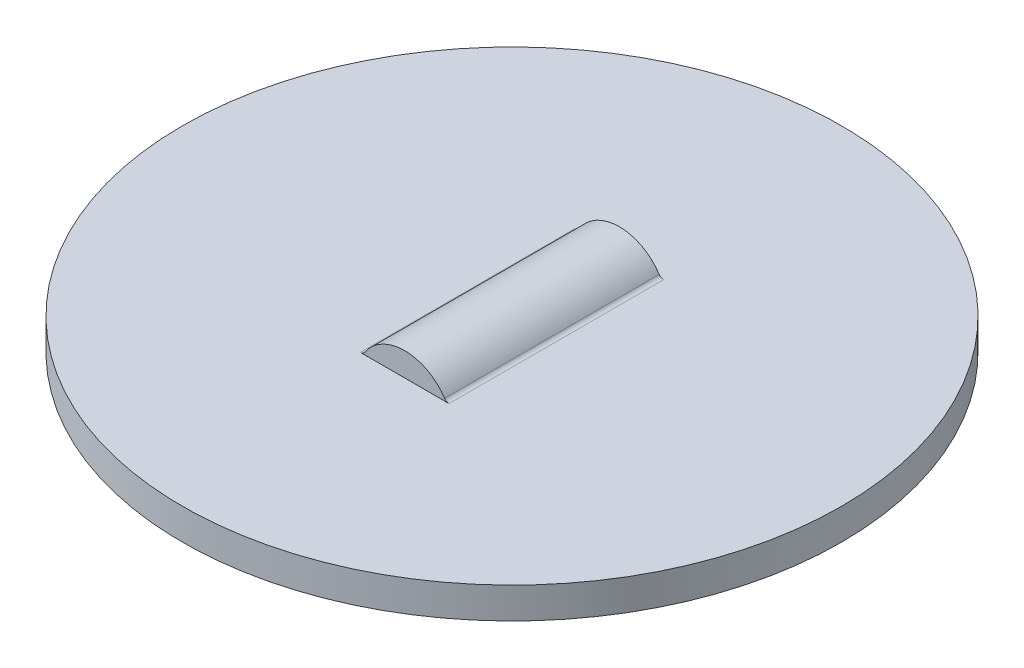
ISO-10303-21;
HEADER;
FILE_DESCRIPTION(('STEP AP214'),'2;1');
FILE_NAME('part.step','',(''),(''),'','','');
FILE_SCHEMA(('AUTOMOTIVE_DESIGN { 1 0 10303 214 1 1 1 1 }'));
ENDSEC;
DATA;
#1=APPLICATION_CONTEXT('core data for automotive mechanical design processes');
#2=APPLICATION_PROTOCOL_DEFINITION('international standard','automotive_design',2000,#1);
#3=PRODUCT_CONTEXT('',#1,'mechanical');
#4=PRODUCT('Part','Part','',(#3));
#5=PRODUCT_RELATED_PRODUCT_CATEGORY('part','',(#4));
#6=PRODUCT_DEFINITION_FORMATION('','',#4);
#7=PRODUCT_DEFINITION_CONTEXT('part definition',#1,'design');
#8=PRODUCT_DEFINITION('design','',#6,#7);
#9=PRODUCT_DEFINITION_SHAPE('','',#8);
#10=(LENGTH_UNIT() NAMED_UNIT(*) SI_UNIT(.MILLI.,.METRE.));
#11=(NAMED_UNIT(*) PLANE_ANGLE_UNIT() SI_UNIT($,.RADIAN.));
#12=(NAMED_UNIT(*) SI_UNIT($,.STERADIAN.) SOLID_ANGLE_UNIT());
#13=UNCERTAINTY_MEASURE_WITH_UNIT(LENGTH_MEASURE(1.E-05),#10,'distance_accuracy_value','');
#14=(GEOMETRIC_REPRESENTATION_CONTEXT(3) GLOBAL_UNCERTAINTY_ASSIGNED_CONTEXT((#13)) GLOBAL_UNIT_ASSIGNED_CONTEXT((#10,
#11,#12)) REPRESENTATION_CONTEXT('',''));
#15=CARTESIAN_POINT('',(0.,0.,0.));
#16=DIRECTION('',(0.,0.,1.));
#17=DIRECTION('',(1.,0.,0.));
#18=AXIS2_PLACEMENT_3D('',#15,#16,#17);
#19=CARTESIAN_POINT('',(0.,-1.1684,10.3378));
#20=DIRECTION('',(0.,0.,-1.));
#21=DIRECTION('',(-1.,0.,0.));
#22=AXIS2_PLACEMENT_3D('',#19,#20,#21);
#23=CYLINDRICAL_SURFACE('',#22,2.3114);
#24=CARTESIAN_POINT('',(0.,-1.1684,0.));
#25=DIRECTION('',(0.,0.,-1.));
#26=DIRECTION('',(-1.,0.,0.));
#27=AXIS2_PLACEMENT_3D('',#24,#25,#26);
#28=CIRCLE('',#27,2.3114);
#29=CARTESIAN_POINT('',(1.92357807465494,0.113168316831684,0.));
#30=VERTEX_POINT('',#29);
#31=CARTESIAN_POINT('',(-1.92357807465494,0.113168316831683,0.));
#32=VERTEX_POINT('',#31);
#33=EDGE_CURVE('E96',#30,#32,#28,.F.);
#34=ORIENTED_EDGE('',*,*,#33,.T.);
#35=DIRECTION('',(0.,0.,-1.));
#36=VECTOR('',#35,1.);
#37=CARTESIAN_POINT('',(-1.92357807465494,0.113168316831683,10.3378));
#38=LINE('',#37,#36);
#39=CARTESIAN_POINT('',(-1.92357807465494,0.113168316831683,10.3378));
#40=VERTEX_POINT('',#39);
#41=EDGE_CURVE('E107',#32,#40,#38,.F.);
#42=ORIENTED_EDGE('',*,*,#41,.T.);
#43=CARTESIAN_POINT('',(0.,-1.1684,10.3378));
#44=DIRECTION('',(0.,0.,-1.));
#45=DIRECTION('',(-1.,0.,0.));
#46=AXIS2_PLACEMENT_3D('',#43,#44,#45);
#47=CIRCLE('',#46,2.3114);
#48=CARTESIAN_POINT('',(1.92357807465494,0.113168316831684,10.3378));
#49=VERTEX_POINT('',#48);
#50=EDGE_CURVE('E138',#49,#40,#47,.F.);
#51=ORIENTED_EDGE('',*,*,#50,.F.);
#52=DIRECTION('',(0.,0.,-1.));
#53=VECTOR('',#52,1.);
#54=CARTESIAN_POINT('',(1.92357807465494,0.113168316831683,10.3378));
#55=LINE('',#54,#53);
#56=EDGE_CURVE('E97',#49,#30,#55,.T.);
#57=ORIENTED_EDGE('',*,*,#56,.T.);
#58=EDGE_LOOP('',(#34,#42,#51,#57));
#59=FACE_BOUND('',#58,.T.);
#60=ADVANCED_FACE('F18',(#59),#23,.T.);
#61=CARTESIAN_POINT('',(2.13496028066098,0.254,10.3378));
#62=DIRECTION('',(0.,0.,-1.));
#63=DIRECTION('',(-1.,0.,0.));
#64=AXIS2_PLACEMENT_3D('',#61,#62,#63);
#65=CYLINDRICAL_SURFACE('',#64,0.254);
#66=CARTESIAN_POINT('',(2.13496028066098,0.254,10.3378));
#67=DIRECTION('',(0.,0.,-1.));
#68=DIRECTION('',(-1.,0.,0.));
#69=AXIS2_PLACEMENT_3D('',#66,#67,#68);
#70=CIRCLE('',#69,0.254);
#71=CARTESIAN_POINT('',(2.13496028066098,0.,10.3378));
#72=VERTEX_POINT('',#71);
#73=EDGE_CURVE('E84',#72,#49,#70,.T.);
#74=ORIENTED_EDGE('',*,*,#73,.F.);
#75=DIRECTION('',(0.,0.,1.));
#76=VECTOR('',#75,1.);
#77=CARTESIAN_POINT('',(2.13496028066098,0.,10.3378));
#78=LINE('',#77,#76);
#79=CARTESIAN_POINT('',(2.13496028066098,0.,0.));
#80=VERTEX_POINT('',#79);
#81=EDGE_CURVE('E79',#72,#80,#78,.F.);
#82=ORIENTED_EDGE('',*,*,#81,.T.);
#83=CARTESIAN_POINT('',(2.13496028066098,0.254,0.));
#84=DIRECTION('',(0.,0.,-1.));
#85=DIRECTION('',(-1.,0.,0.));
#86=AXIS2_PLACEMENT_3D('',#83,#84,#85);
#87=CIRCLE('',#86,0.254);
#88=EDGE_CURVE('E21',#80,#30,#87,.T.);
#89=ORIENTED_EDGE('',*,*,#88,.T.);
#90=ORIENTED_EDGE('',*,*,#56,.F.);
#91=EDGE_LOOP('',(#74,#82,#89,#90));
#92=FACE_BOUND('',#91,.T.);
#93=ADVANCED_FACE('F81',(#92),#65,.F.);
#94=CARTESIAN_POINT('',(0.,-1.1684,0.));
#95=DIRECTION('',(0.,0.,1.));
#96=DIRECTION('',(1.,0.,0.));
#97=AXIS2_PLACEMENT_3D('',#94,#95,#96);
#98=PLANE('',#97);
#99=CARTESIAN_POINT('',(-2.13496028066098,0.254,0.));
#100=DIRECTION('',(0.,0.,-1.));
#101=DIRECTION('',(-1.,0.,0.));
#102=AXIS2_PLACEMENT_3D('',#99,#100,#101);
#103=CIRCLE('',#102,0.253999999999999);
#104=CARTESIAN_POINT('',(-2.13496028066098,0.,0.));
#105=VERTEX_POINT('',#104);
#106=EDGE_CURVE('E109',#105,#32,#103,.F.);
#107=ORIENTED_EDGE('',*,*,#106,.T.);
#108=ORIENTED_EDGE('',*,*,#33,.F.);
#109=ORIENTED_EDGE('',*,*,#88,.F.);
#110=DIRECTION('',(1.,0.,0.));
#111=VECTOR('',#110,1.);
#112=CARTESIAN_POINT('',(2.13496028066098,0.,0.));
#113=LINE('',#112,#111);
#114=EDGE_CURVE('E89',#80,#105,#113,.F.);
#115=ORIENTED_EDGE('',*,*,#114,.T.);
#116=EDGE_LOOP('',(#107,#108,#109,#115));
#117=FACE_BOUND('',#116,.T.);
#118=ADVANCED_FACE('F94',(#117),#98,.F.);
#119=CARTESIAN_POINT('',(-2.13496028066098,0.254,10.3378));
#120=DIRECTION('',(0.,0.,-1.));
#121=DIRECTION('',(-1.,0.,0.));
#122=AXIS2_PLACEMENT_3D('',#119,#120,#121);
#123=CYLINDRICAL_SURFACE('',#122,0.253999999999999);
#124=CARTESIAN_POINT('',(-2.13496028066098,0.254,10.3378));
#125=DIRECTION('',(0.,0.,-1.));
#126=DIRECTION('',(-1.,0.,0.));
#127=AXIS2_PLACEMENT_3D('',#124,#125,#126);
#128=CIRCLE('',#127,0.253999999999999);
#129=CARTESIAN_POINT('',(-2.13496028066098,0.,10.3378));
#130=VERTEX_POINT('',#129);
#131=EDGE_CURVE('E90',#40,#130,#128,.T.);
#132=ORIENTED_EDGE('',*,*,#131,.F.);
#133=ORIENTED_EDGE('',*,*,#41,.F.);
#134=ORIENTED_EDGE('',*,*,#106,.F.);
#135=DIRECTION('',(0.,0.,1.));
#136=VECTOR('',#135,1.);
#137=CARTESIAN_POINT('',(-2.13496028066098,0.,10.3378));
#138=LINE('',#137,#136);
#139=EDGE_CURVE('E101',#105,#130,#138,.T.);
#140=ORIENTED_EDGE('',*,*,#139,.T.);
#141=EDGE_LOOP('',(#132,#133,#134,#140));
#142=FACE_BOUND('',#141,.T.);
#143=ADVANCED_FACE('F147',(#142),#123,.F.);
#144=CARTESIAN_POINT('',(2.13496028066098,0.254,10.3378));
#145=DIRECTION('',(0.,0.,1.));
#146=DIRECTION('',(1.,0.,0.));
#147=AXIS2_PLACEMENT_3D('',#144,#145,#146);
#148=PLANE('',#147);
#149=ORIENTED_EDGE('',*,*,#50,.T.);
#150=ORIENTED_EDGE('',*,*,#131,.T.);
#151=DIRECTION('',(1.,0.,0.));
#152=VECTOR('',#151,1.);
#153=CARTESIAN_POINT('',(2.13496028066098,0.,10.3378));
#154=LINE('',#153,#152);
#155=EDGE_CURVE('E103',#130,#72,#154,.T.);
#156=ORIENTED_EDGE('',*,*,#155,.T.);
#157=ORIENTED_EDGE('',*,*,#73,.T.);
#158=EDGE_LOOP('',(#149,#150,#156,#157));
#159=FACE_BOUND('',#158,.T.);
#160=ADVANCED_FACE('F149',(#159),#148,.T.);
#161=CARTESIAN_POINT('',(2.13496028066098,0.,10.3378));
#162=DIRECTION('',(0.,-1.,0.));
#163=DIRECTION('',(1.,0.,0.));
#164=AXIS2_PLACEMENT_3D('',#161,#162,#163);
#165=PLANE('',#164);
#166=ORIENTED_EDGE('',*,*,#139,.F.);
#167=ORIENTED_EDGE('',*,*,#114,.F.);
#168=ORIENTED_EDGE('',*,*,#81,.F.);
#169=ORIENTED_EDGE('',*,*,#155,.F.);
#170=EDGE_LOOP('',(#166,#167,#168,#169));
#171=FACE_BOUND('',#170,.T.);
#172=CARTESIAN_POINT('',(0.,0.,5.1689));
#173=DIRECTION('',(0.,-1.,0.));
#174=DIRECTION('',(1.,0.,0.));
#175=AXIS2_PLACEMENT_3D('',#172,#173,#174);
#176=CIRCLE('',#175,15.875);
#177=CARTESIAN_POINT('',(15.875,0.,5.1689));
#178=VERTEX_POINT('',#177);
#179=EDGE_CURVE('E133',#178,#178,#176,.T.);
#180=ORIENTED_EDGE('',*,*,#179,.F.);
#181=EDGE_LOOP('',(#180));
#182=FACE_BOUND('',#181,.T.);
#183=ADVANCED_FACE('F99',(#171,#182),#165,.F.);
#184=CARTESIAN_POINT('',(0.,-1.1684,10.3378));
#185=DIRECTION('',(0.,0.,-1.));
#186=DIRECTION('',(-1.,0.,0.));
#187=AXIS2_PLACEMENT_3D('',#184,#185,#186);
#188=CYLINDRICAL_SURFACE('',#187,0.812800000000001);
#189=DIRECTION('',(0.,0.,-1.));
#190=VECTOR('',#189,1.);
#191=CARTESIAN_POINT('',(-0.676423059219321,-0.717738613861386,10.3378));
#192=LINE('',#191,#190);
#193=CARTESIAN_POINT('',(-0.676423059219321,-0.717738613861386,0.));
#194=VERTEX_POINT('',#193);
#195=CARTESIAN_POINT('',(-0.676423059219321,-0.717738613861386,10.3378));
#196=VERTEX_POINT('',#195);
#197=EDGE_CURVE('E119',#194,#196,#192,.F.);
#198=ORIENTED_EDGE('',*,*,#197,.F.);
#199=CARTESIAN_POINT('',(0.,-1.1684,0.));
#200=DIRECTION('',(0.,0.,-1.));
#201=DIRECTION('',(-1.,0.,0.));
#202=AXIS2_PLACEMENT_3D('',#199,#200,#201);
#203=CIRCLE('',#202,0.812800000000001);
#204=CARTESIAN_POINT('',(0.676423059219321,-0.717738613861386,0.));
#205=VERTEX_POINT('',#204);
#206=EDGE_CURVE('E121',#194,#205,#203,.T.);
#207=ORIENTED_EDGE('',*,*,#206,.T.);
#208=DIRECTION('',(0.,0.,-1.));
#209=VECTOR('',#208,1.);
#210=CARTESIAN_POINT('',(0.676423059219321,-0.717738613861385,10.3378));
#211=LINE('',#210,#209);
#212=CARTESIAN_POINT('',(0.676423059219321,-0.717738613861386,10.3378));
#213=VERTEX_POINT('',#212);
#214=EDGE_CURVE('E129',#213,#205,#211,.T.);
#215=ORIENTED_EDGE('',*,*,#214,.F.);
#216=CARTESIAN_POINT('',(0.,-1.1684,10.3378));
#217=DIRECTION('',(0.,0.,-1.));
#218=DIRECTION('',(-1.,0.,0.));
#219=AXIS2_PLACEMENT_3D('',#216,#217,#218);
#220=CIRCLE('',#219,0.812800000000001);
#221=EDGE_CURVE('E130',#196,#213,#220,.T.);
#222=ORIENTED_EDGE('',*,*,#221,.F.);
#223=EDGE_LOOP('',(#198,#207,#215,#222));
#224=FACE_BOUND('',#223,.T.);
#225=ADVANCED_FACE('F223',(#224),#188,.F.);
#226=CARTESIAN_POINT('',(0.,0.,5.1689));
#227=DIRECTION('',(0.,-1.,0.));
#228=DIRECTION('',(1.,0.,0.));
#229=AXIS2_PLACEMENT_3D('',#226,#227,#228);
#230=CYLINDRICAL_SURFACE('',#229,15.875);
#231=CARTESIAN_POINT('',(0.,-1.4986,5.1689));
#232=DIRECTION('',(0.,-1.,0.));
#233=DIRECTION('',(1.,0.,0.));
#234=AXIS2_PLACEMENT_3D('',#231,#232,#233);
#235=CIRCLE('',#234,15.875);
#236=CARTESIAN_POINT('',(15.875,-1.4986,5.1689));
#237=VERTEX_POINT('',#236);
#238=EDGE_CURVE('E112',#237,#237,#235,.T.);
#239=ORIENTED_EDGE('',*,*,#238,.F.);
#240=EDGE_LOOP('',(#239));
#241=FACE_BOUND('',#240,.T.);
#242=ORIENTED_EDGE('',*,*,#179,.T.);
#243=EDGE_LOOP('',(#242));
#244=FACE_BOUND('',#243,.T.);
#245=ADVANCED_FACE('F213',(#241,#244),#230,.T.);
#246=CARTESIAN_POINT('',(-2.13496028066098,0.,10.3378));
#247=DIRECTION('',(0.,0.,-1.));
#248=DIRECTION('',(-1.,0.,0.));
#249=AXIS2_PLACEMENT_3D('',#246,#247,#248);
#250=PLANE('',#249);
#251=ORIENTED_EDGE('',*,*,#221,.T.);
#252=CARTESIAN_POINT('',(2.13496028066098,0.254,10.3378));
#253=DIRECTION('',(0.,0.,-1.));
#254=DIRECTION('',(-1.,0.,0.));
#255=AXIS2_PLACEMENT_3D('',#252,#253,#254);
#256=CIRCLE('',#255,1.7526);
#257=CARTESIAN_POINT('',(2.13496028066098,-1.4986,10.3378));
#258=VERTEX_POINT('',#257);
#259=EDGE_CURVE('E126',#258,#213,#256,.T.);
#260=ORIENTED_EDGE('',*,*,#259,.F.);
#261=DIRECTION('',(1.,0.,0.));
#262=VECTOR('',#261,1.);
#263=CARTESIAN_POINT('',(2.13496028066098,-1.4986,10.3378));
#264=LINE('',#263,#262);
#265=CARTESIAN_POINT('',(-2.13496028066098,-1.4986,10.3378));
#266=VERTEX_POINT('',#265);
#267=EDGE_CURVE('E115',#266,#258,#264,.T.);
#268=ORIENTED_EDGE('',*,*,#267,.F.);
#269=CARTESIAN_POINT('',(-2.13496028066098,0.254,10.3378));
#270=DIRECTION('',(0.,0.,-1.));
#271=DIRECTION('',(-1.,0.,0.));
#272=AXIS2_PLACEMENT_3D('',#269,#270,#271);
#273=CIRCLE('',#272,1.7526);
#274=EDGE_CURVE('E116',#196,#266,#273,.T.);
#275=ORIENTED_EDGE('',*,*,#274,.F.);
#276=EDGE_LOOP('',(#251,#260,#268,#275));
#277=FACE_BOUND('',#276,.T.);
#278=ADVANCED_FACE('F179',(#277),#250,.T.);
#279=CARTESIAN_POINT('',(2.13496028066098,0.254,10.3378));
#280=DIRECTION('',(0.,0.,-1.));
#281=DIRECTION('',(-1.,0.,0.));
#282=AXIS2_PLACEMENT_3D('',#279,#280,#281);
#283=CYLINDRICAL_SURFACE('',#282,1.7526);
#284=DIRECTION('',(0.,0.,1.));
#285=VECTOR('',#284,1.);
#286=CARTESIAN_POINT('',(2.13496028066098,-1.4986,10.3378));
#287=LINE('',#286,#285);
#288=CARTESIAN_POINT('',(2.13496028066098,-1.4986,0.));
#289=VERTEX_POINT('',#288);
#290=EDGE_CURVE('E155',#258,#289,#287,.F.);
#291=ORIENTED_EDGE('',*,*,#290,.F.);
#292=ORIENTED_EDGE('',*,*,#259,.T.);
#293=ORIENTED_EDGE('',*,*,#214,.T.);
#294=CARTESIAN_POINT('',(2.13496028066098,0.254,0.));
#295=DIRECTION('',(0.,0.,-1.));
#296=DIRECTION('',(-1.,0.,0.));
#297=AXIS2_PLACEMENT_3D('',#294,#295,#296);
#298=CIRCLE('',#297,1.7526);
#299=EDGE_CURVE('E124',#205,#289,#298,.F.);
#300=ORIENTED_EDGE('',*,*,#299,.T.);
#301=EDGE_LOOP('',(#291,#292,#293,#300));
#302=FACE_BOUND('',#301,.T.);
#303=ADVANCED_FACE('F166',(#302),#283,.T.);
#304=CARTESIAN_POINT('',(-2.13496028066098,0.,0.));
#305=DIRECTION('',(0.,0.,-1.));
#306=DIRECTION('',(-1.,0.,0.));
#307=AXIS2_PLACEMENT_3D('',#304,#305,#306);
#308=PLANE('',#307);
#309=CARTESIAN_POINT('',(-2.13496028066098,0.254,0.));
#310=DIRECTION('',(0.,0.,-1.));
#311=DIRECTION('',(-1.,0.,0.));
#312=AXIS2_PLACEMENT_3D('',#309,#310,#311);
#313=CIRCLE('',#312,1.7526);
#314=CARTESIAN_POINT('',(-2.13496028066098,-1.4986,0.));
#315=VERTEX_POINT('',#314);
#316=EDGE_CURVE('E36',#315,#194,#313,.F.);
#317=ORIENTED_EDGE('',*,*,#316,.F.);
#318=DIRECTION('',(1.,0.,0.));
#319=VECTOR('',#318,1.);
#320=CARTESIAN_POINT('',(2.13496028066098,-1.4986,0.));
#321=LINE('',#320,#319);
#322=EDGE_CURVE('E27',#289,#315,#321,.F.);
#323=ORIENTED_EDGE('',*,*,#322,.F.);
#324=ORIENTED_EDGE('',*,*,#299,.F.);
#325=ORIENTED_EDGE('',*,*,#206,.F.);
#326=EDGE_LOOP('',(#317,#323,#324,#325));
#327=FACE_BOUND('',#326,.T.);
#328=ADVANCED_FACE('F168',(#327),#308,.F.);
#329=CARTESIAN_POINT('',(-2.13496028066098,0.254,10.3378));
#330=DIRECTION('',(0.,0.,-1.));
#331=DIRECTION('',(-1.,0.,0.));
#332=AXIS2_PLACEMENT_3D('',#329,#330,#331);
#333=CYLINDRICAL_SURFACE('',#332,1.7526);
#334=ORIENTED_EDGE('',*,*,#197,.T.);
#335=ORIENTED_EDGE('',*,*,#274,.T.);
#336=DIRECTION('',(0.,0.,1.));
#337=VECTOR('',#336,1.);
#338=CARTESIAN_POINT('',(-2.13496028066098,-1.4986,10.3378));
#339=LINE('',#338,#337);
#340=EDGE_CURVE('E11',#315,#266,#339,.T.);
#341=ORIENTED_EDGE('',*,*,#340,.F.);
#342=ORIENTED_EDGE('',*,*,#316,.T.);
#343=EDGE_LOOP('',(#334,#335,#341,#342));
#344=FACE_BOUND('',#343,.T.);
#345=ADVANCED_FACE('F170',(#344),#333,.T.);
#346=CARTESIAN_POINT('',(2.13496028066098,-1.4986,10.3378));
#347=DIRECTION('',(0.,-1.,0.));
#348=DIRECTION('',(1.,0.,0.));
#349=AXIS2_PLACEMENT_3D('',#346,#347,#348);
#350=PLANE('',#349);
#351=ORIENTED_EDGE('',*,*,#322,.T.);
#352=ORIENTED_EDGE('',*,*,#340,.T.);
#353=ORIENTED_EDGE('',*,*,#267,.T.);
#354=ORIENTED_EDGE('',*,*,#290,.T.);
#355=EDGE_LOOP('',(#351,#352,#353,#354));
#356=FACE_BOUND('',#355,.T.);
#357=ORIENTED_EDGE('',*,*,#238,.T.);
#358=EDGE_LOOP('',(#357));
#359=FACE_BOUND('',#358,.T.);
#360=ADVANCED_FACE('F162',(#356,#359),#350,.T.);
#361=CLOSED_SHELL('',(#60,#93,#118,#143,#160,#183,#225,#245,#278,#303,#328,#345,#360));
#362=MANIFOLD_SOLID_BREP('B1',#361);
#363=ADVANCED_BREP_SHAPE_REPRESENTATION('',(#18,#362),#14);
#364=SHAPE_DEFINITION_REPRESENTATION(#9,#363);
ENDSEC;
END-ISO-10303-21;
